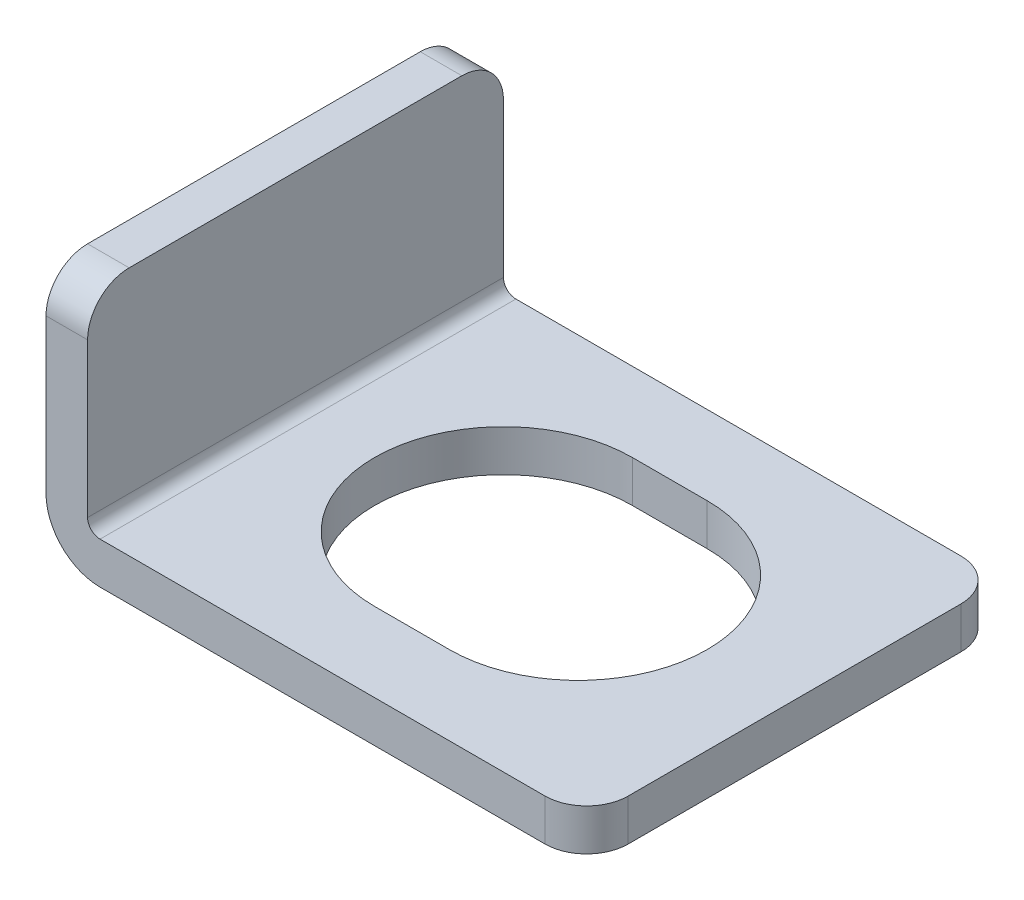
ISO-10303-21;
HEADER;
FILE_DESCRIPTION(('STEP AP214'),'2;1');
FILE_NAME('part.step','',(''),(''),'','','');
FILE_SCHEMA(('AUTOMOTIVE_DESIGN { 1 0 10303 214 1 1 1 1 }'));
ENDSEC;
DATA;
#1=APPLICATION_CONTEXT('core data for automotive mechanical design processes');
#2=APPLICATION_PROTOCOL_DEFINITION('international standard','automotive_design',2000,#1);
#3=PRODUCT_CONTEXT('',#1,'mechanical');
#4=PRODUCT('Part','Part','',(#3));
#5=PRODUCT_RELATED_PRODUCT_CATEGORY('part','',(#4));
#6=PRODUCT_DEFINITION_FORMATION('','',#4);
#7=PRODUCT_DEFINITION_CONTEXT('part definition',#1,'design');
#8=PRODUCT_DEFINITION('design','',#6,#7);
#9=PRODUCT_DEFINITION_SHAPE('','',#8);
#10=(LENGTH_UNIT() NAMED_UNIT(*) SI_UNIT(.MILLI.,.METRE.));
#11=(NAMED_UNIT(*) PLANE_ANGLE_UNIT() SI_UNIT($,.RADIAN.));
#12=(NAMED_UNIT(*) SI_UNIT($,.STERADIAN.) SOLID_ANGLE_UNIT());
#13=UNCERTAINTY_MEASURE_WITH_UNIT(LENGTH_MEASURE(1.E-05),#10,'distance_accuracy_value','');
#14=(GEOMETRIC_REPRESENTATION_CONTEXT(3) GLOBAL_UNCERTAINTY_ASSIGNED_CONTEXT((#13)) GLOBAL_UNIT_ASSIGNED_CONTEXT((#10,
#11,#12)) REPRESENTATION_CONTEXT('',''));
#15=CARTESIAN_POINT('',(0.,0.,0.));
#16=DIRECTION('',(0.,0.,1.));
#17=DIRECTION('',(1.,0.,0.));
#18=AXIS2_PLACEMENT_3D('',#15,#16,#17);
#19=CARTESIAN_POINT('',(-5.,0.3,5.));
#20=DIRECTION('',(-1.,0.,0.));
#21=DIRECTION('',(0.,-1.,0.));
#22=AXIS2_PLACEMENT_3D('',#19,#20,#21);
#23=PLANE('',#22);
#24=DIRECTION('',(0.,1.,0.));
#25=VECTOR('',#24,1.);
#26=CARTESIAN_POINT('',(-5.,0.3,-5.));
#27=LINE('',#26,#25);
#28=CARTESIAN_POINT('',(-5.,0.3,-5.));
#29=VERTEX_POINT('',#28);
#30=CARTESIAN_POINT('',(-5.,4.,-5.));
#31=VERTEX_POINT('',#30);
#32=EDGE_CURVE('E167',#29,#31,#27,.T.);
#33=ORIENTED_EDGE('',*,*,#32,.T.);
#34=CARTESIAN_POINT('',(-5.,4.,-4.));
#35=DIRECTION('',(-1.,0.,0.));
#36=DIRECTION('',(0.,-1.,0.));
#37=AXIS2_PLACEMENT_3D('',#34,#35,#36);
#38=CIRCLE('',#37,1.);
#39=CARTESIAN_POINT('',(-5.,5.,-4.));
#40=VERTEX_POINT('',#39);
#41=EDGE_CURVE('E245',#31,#40,#38,.F.);
#42=ORIENTED_EDGE('',*,*,#41,.T.);
#43=DIRECTION('',(0.,0.,-1.));
#44=VECTOR('',#43,1.);
#45=CARTESIAN_POINT('',(-5.,5.,5.));
#46=LINE('',#45,#44);
#47=CARTESIAN_POINT('',(-5.,5.,4.));
#48=VERTEX_POINT('',#47);
#49=EDGE_CURVE('E218',#48,#40,#46,.T.);
#50=ORIENTED_EDGE('',*,*,#49,.F.);
#51=CARTESIAN_POINT('',(-5.,4.,4.));
#52=DIRECTION('',(-1.,0.,0.));
#53=DIRECTION('',(0.,-1.,0.));
#54=AXIS2_PLACEMENT_3D('',#51,#52,#53);
#55=CIRCLE('',#54,1.);
#56=CARTESIAN_POINT('',(-5.,4.,5.));
#57=VERTEX_POINT('',#56);
#58=EDGE_CURVE('E243',#48,#57,#55,.F.);
#59=ORIENTED_EDGE('',*,*,#58,.T.);
#60=DIRECTION('',(0.,1.,0.));
#61=VECTOR('',#60,1.);
#62=CARTESIAN_POINT('',(-5.,0.3,5.));
#63=LINE('',#62,#61);
#64=CARTESIAN_POINT('',(-5.,0.3,5.));
#65=VERTEX_POINT('',#64);
#66=EDGE_CURVE('E171',#65,#57,#63,.T.);
#67=ORIENTED_EDGE('',*,*,#66,.F.);
#68=DIRECTION('',(0.,0.,-1.));
#69=VECTOR('',#68,1.);
#70=CARTESIAN_POINT('',(-5.,0.3,5.));
#71=LINE('',#70,#69);
#72=EDGE_CURVE('E186',#65,#29,#71,.T.);
#73=ORIENTED_EDGE('',*,*,#72,.T.);
#74=EDGE_LOOP('',(#33,#42,#50,#59,#67,#73));
#75=FACE_BOUND('',#74,.T.);
#76=ADVANCED_FACE('F14',(#75),#23,.F.);
#77=CARTESIAN_POINT('',(-6.,5.,5.));
#78=DIRECTION('',(0.,1.,0.));
#79=DIRECTION('',(0.,0.,1.));
#80=AXIS2_PLACEMENT_3D('',#77,#78,#79);
#81=PLANE('',#80);
#82=ORIENTED_EDGE('',*,*,#49,.T.);
#83=DIRECTION('',(1.,0.,0.));
#84=VECTOR('',#83,1.);
#85=CARTESIAN_POINT('',(-6.,5.,-4.));
#86=LINE('',#85,#84);
#87=CARTESIAN_POINT('',(-6.,5.,-4.));
#88=VERTEX_POINT('',#87);
#89=EDGE_CURVE('E29',#40,#88,#86,.F.);
#90=ORIENTED_EDGE('',*,*,#89,.T.);
#91=DIRECTION('',(0.,0.,-1.));
#92=VECTOR('',#91,1.);
#93=CARTESIAN_POINT('',(-6.,5.,5.));
#94=LINE('',#93,#92);
#95=CARTESIAN_POINT('',(-6.,5.,4.));
#96=VERTEX_POINT('',#95);
#97=EDGE_CURVE('E216',#96,#88,#94,.T.);
#98=ORIENTED_EDGE('',*,*,#97,.F.);
#99=DIRECTION('',(1.,0.,0.));
#100=VECTOR('',#99,1.);
#101=CARTESIAN_POINT('',(-6.,5.,4.));
#102=LINE('',#101,#100);
#103=EDGE_CURVE('E247',#96,#48,#102,.T.);
#104=ORIENTED_EDGE('',*,*,#103,.T.);
#105=EDGE_LOOP('',(#82,#90,#98,#104));
#106=FACE_BOUND('',#105,.T.);
#107=ADVANCED_FACE('F252',(#106),#81,.T.);
#108=CARTESIAN_POINT('',(-6.,0.3,5.));
#109=DIRECTION('',(-1.,0.,0.));
#110=DIRECTION('',(0.,-1.,0.));
#111=AXIS2_PLACEMENT_3D('',#108,#109,#110);
#112=PLANE('',#111);
#113=ORIENTED_EDGE('',*,*,#97,.T.);
#114=CARTESIAN_POINT('',(-6.,4.,-4.));
#115=DIRECTION('',(-1.,0.,0.));
#116=DIRECTION('',(0.,-1.,0.));
#117=AXIS2_PLACEMENT_3D('',#114,#115,#116);
#118=CIRCLE('',#117,1.);
#119=CARTESIAN_POINT('',(-6.,4.,-5.));
#120=VERTEX_POINT('',#119);
#121=EDGE_CURVE('E9',#88,#120,#118,.T.);
#122=ORIENTED_EDGE('',*,*,#121,.T.);
#123=DIRECTION('',(0.,1.,0.));
#124=VECTOR('',#123,1.);
#125=CARTESIAN_POINT('',(-6.,0.3,-5.));
#126=LINE('',#125,#124);
#127=CARTESIAN_POINT('',(-6.,0.3,-5.));
#128=VERTEX_POINT('',#127);
#129=EDGE_CURVE('E189',#128,#120,#126,.T.);
#130=ORIENTED_EDGE('',*,*,#129,.F.);
#131=DIRECTION('',(0.,0.,-1.));
#132=VECTOR('',#131,1.);
#133=CARTESIAN_POINT('',(-6.,0.3,5.));
#134=LINE('',#133,#132);
#135=CARTESIAN_POINT('',(-6.,0.3,5.));
#136=VERTEX_POINT('',#135);
#137=EDGE_CURVE('E214',#136,#128,#134,.T.);
#138=ORIENTED_EDGE('',*,*,#137,.F.);
#139=DIRECTION('',(0.,1.,0.));
#140=VECTOR('',#139,1.);
#141=CARTESIAN_POINT('',(-6.,0.3,5.));
#142=LINE('',#141,#140);
#143=CARTESIAN_POINT('',(-6.,4.,5.));
#144=VERTEX_POINT('',#143);
#145=EDGE_CURVE('E174',#136,#144,#142,.T.);
#146=ORIENTED_EDGE('',*,*,#145,.T.);
#147=CARTESIAN_POINT('',(-6.,4.,4.));
#148=DIRECTION('',(-1.,0.,0.));
#149=DIRECTION('',(0.,-1.,0.));
#150=AXIS2_PLACEMENT_3D('',#147,#148,#149);
#151=CIRCLE('',#150,1.);
#152=EDGE_CURVE('E22',#144,#96,#151,.T.);
#153=ORIENTED_EDGE('',*,*,#152,.T.);
#154=EDGE_LOOP('',(#113,#122,#130,#138,#146,#153));
#155=FACE_BOUND('',#154,.T.);
#156=ADVANCED_FACE('F267',(#155),#112,.T.);
#157=CARTESIAN_POINT('',(-4.7,0.3,5.));
#158=DIRECTION('',(0.,0.,-1.));
#159=DIRECTION('',(-1.,0.,0.));
#160=AXIS2_PLACEMENT_3D('',#157,#158,#159);
#161=CYLINDRICAL_SURFACE('',#160,1.3);
#162=CARTESIAN_POINT('',(-4.7,0.3,-5.));
#163=DIRECTION('',(0.,0.,1.));
#164=DIRECTION('',(1.,0.,0.));
#165=AXIS2_PLACEMENT_3D('',#162,#163,#164);
#166=CIRCLE('',#165,1.3);
#167=CARTESIAN_POINT('',(-4.7,-1.,-5.));
#168=VERTEX_POINT('',#167);
#169=EDGE_CURVE('E192',#168,#128,#166,.F.);
#170=ORIENTED_EDGE('',*,*,#169,.F.);
#171=DIRECTION('',(0.,0.,-1.));
#172=VECTOR('',#171,1.);
#173=CARTESIAN_POINT('',(-4.7,-1.,5.));
#174=LINE('',#173,#172);
#175=CARTESIAN_POINT('',(-4.7,-1.,5.));
#176=VERTEX_POINT('',#175);
#177=EDGE_CURVE('E211',#176,#168,#174,.T.);
#178=ORIENTED_EDGE('',*,*,#177,.F.);
#179=CARTESIAN_POINT('',(-4.7,0.3,5.));
#180=DIRECTION('',(0.,0.,1.));
#181=DIRECTION('',(1.,0.,0.));
#182=AXIS2_PLACEMENT_3D('',#179,#180,#181);
#183=CIRCLE('',#182,1.3);
#184=EDGE_CURVE('E177',#176,#136,#183,.F.);
#185=ORIENTED_EDGE('',*,*,#184,.T.);
#186=ORIENTED_EDGE('',*,*,#137,.T.);
#187=EDGE_LOOP('',(#170,#178,#185,#186));
#188=FACE_BOUND('',#187,.T.);
#189=ADVANCED_FACE('F276',(#188),#161,.T.);
#190=CARTESIAN_POINT('',(0.,-1.,5.));
#191=DIRECTION('',(0.,-1.,0.));
#192=DIRECTION('',(0.,0.,-1.));
#193=AXIS2_PLACEMENT_3D('',#190,#191,#192);
#194=PLANE('',#193);
#195=CARTESIAN_POINT('',(0.,-1.,0.));
#196=DIRECTION('',(0.,1.,0.));
#197=DIRECTION('',(-1.,0.,0.));
#198=AXIS2_PLACEMENT_3D('',#195,#196,#197);
#199=CIRCLE('',#198,3.1);
#200=CARTESIAN_POINT('',(0.,-1.,-3.1));
#201=VERTEX_POINT('',#200);
#202=CARTESIAN_POINT('',(0.,-1.,3.1));
#203=VERTEX_POINT('',#202);
#204=EDGE_CURVE('E131',#201,#203,#199,.T.);
#205=ORIENTED_EDGE('',*,*,#204,.T.);
#206=DIRECTION('',(1.,0.,0.));
#207=VECTOR('',#206,1.);
#208=CARTESIAN_POINT('',(0.,-1.,3.1));
#209=LINE('',#208,#207);
#210=CARTESIAN_POINT('',(1.8,-1.,3.1));
#211=VERTEX_POINT('',#210);
#212=EDGE_CURVE('E143',#203,#211,#209,.T.);
#213=ORIENTED_EDGE('',*,*,#212,.T.);
#214=CARTESIAN_POINT('',(1.8,-1.,0.));
#215=DIRECTION('',(0.,1.,0.));
#216=DIRECTION('',(1.,0.,0.));
#217=AXIS2_PLACEMENT_3D('',#214,#215,#216);
#218=CIRCLE('',#217,3.1);
#219=CARTESIAN_POINT('',(1.8,-1.,-3.1));
#220=VERTEX_POINT('',#219);
#221=EDGE_CURVE('E147',#211,#220,#218,.T.);
#222=ORIENTED_EDGE('',*,*,#221,.T.);
#223=DIRECTION('',(-1.,0.,0.));
#224=VECTOR('',#223,1.);
#225=CARTESIAN_POINT('',(0.,-1.,-3.1));
#226=LINE('',#225,#224);
#227=EDGE_CURVE('E139',#220,#201,#226,.T.);
#228=ORIENTED_EDGE('',*,*,#227,.T.);
#229=EDGE_LOOP('',(#205,#213,#222,#228));
#230=FACE_BOUND('',#229,.T.);
#231=DIRECTION('',(1.,0.,0.));
#232=VECTOR('',#231,1.);
#233=CARTESIAN_POINT('',(0.,-1.,-5.));
#234=LINE('',#233,#232);
#235=CARTESIAN_POINT('',(6.,-1.,-5.));
#236=VERTEX_POINT('',#235);
#237=EDGE_CURVE('E195',#236,#168,#234,.F.);
#238=ORIENTED_EDGE('',*,*,#237,.F.);
#239=CARTESIAN_POINT('',(6.,-1.,-4.));
#240=DIRECTION('',(0.,-1.,0.));
#241=DIRECTION('',(0.,0.,-1.));
#242=AXIS2_PLACEMENT_3D('',#239,#240,#241);
#243=CIRCLE('',#242,1.);
#244=CARTESIAN_POINT('',(7.,-1.,-4.));
#245=VERTEX_POINT('',#244);
#246=EDGE_CURVE('E228',#236,#245,#243,.T.);
#247=ORIENTED_EDGE('',*,*,#246,.T.);
#248=DIRECTION('',(0.,0.,-1.));
#249=VECTOR('',#248,1.);
#250=CARTESIAN_POINT('',(7.,-1.,5.));
#251=LINE('',#250,#249);
#252=CARTESIAN_POINT('',(7.,-1.,4.));
#253=VERTEX_POINT('',#252);
#254=EDGE_CURVE('E208',#253,#245,#251,.T.);
#255=ORIENTED_EDGE('',*,*,#254,.F.);
#256=CARTESIAN_POINT('',(6.,-1.,4.));
#257=DIRECTION('',(0.,-1.,0.));
#258=DIRECTION('',(0.,0.,-1.));
#259=AXIS2_PLACEMENT_3D('',#256,#257,#258);
#260=CIRCLE('',#259,1.);
#261=CARTESIAN_POINT('',(6.,-1.,5.));
#262=VERTEX_POINT('',#261);
#263=EDGE_CURVE('E226',#253,#262,#260,.T.);
#264=ORIENTED_EDGE('',*,*,#263,.T.);
#265=DIRECTION('',(-1.,0.,0.));
#266=VECTOR('',#265,1.);
#267=CARTESIAN_POINT('',(0.,-1.,5.));
#268=LINE('',#267,#266);
#269=EDGE_CURVE('E180',#262,#176,#268,.T.);
#270=ORIENTED_EDGE('',*,*,#269,.T.);
#271=ORIENTED_EDGE('',*,*,#177,.T.);
#272=EDGE_LOOP('',(#238,#247,#255,#264,#270,#271));
#273=FACE_BOUND('',#272,.T.);
#274=ADVANCED_FACE('F149',(#230,#273),#194,.T.);
#275=CARTESIAN_POINT('',(7.,0.,5.));
#276=DIRECTION('',(1.,0.,0.));
#277=DIRECTION('',(0.,0.,-1.));
#278=AXIS2_PLACEMENT_3D('',#275,#276,#277);
#279=PLANE('',#278);
#280=ORIENTED_EDGE('',*,*,#254,.T.);
#281=DIRECTION('',(0.,-1.,0.));
#282=VECTOR('',#281,1.);
#283=CARTESIAN_POINT('',(7.,0.,-4.));
#284=LINE('',#283,#282);
#285=CARTESIAN_POINT('',(7.,0.,-4.));
#286=VERTEX_POINT('',#285);
#287=EDGE_CURVE('E233',#245,#286,#284,.F.);
#288=ORIENTED_EDGE('',*,*,#287,.T.);
#289=DIRECTION('',(0.,0.,-1.));
#290=VECTOR('',#289,1.);
#291=CARTESIAN_POINT('',(7.,0.,5.));
#292=LINE('',#291,#290);
#293=CARTESIAN_POINT('',(7.,0.,4.));
#294=VERTEX_POINT('',#293);
#295=EDGE_CURVE('E205',#294,#286,#292,.T.);
#296=ORIENTED_EDGE('',*,*,#295,.F.);
#297=DIRECTION('',(0.,-1.,0.));
#298=VECTOR('',#297,1.);
#299=CARTESIAN_POINT('',(7.,0.,4.));
#300=LINE('',#299,#298);
#301=EDGE_CURVE('E230',#294,#253,#300,.T.);
#302=ORIENTED_EDGE('',*,*,#301,.T.);
#303=EDGE_LOOP('',(#280,#288,#296,#302));
#304=FACE_BOUND('',#303,.T.);
#305=ADVANCED_FACE('F291',(#304),#279,.T.);
#306=CARTESIAN_POINT('',(0.,0.,5.));
#307=DIRECTION('',(0.,-1.,0.));
#308=DIRECTION('',(1.,0.,0.));
#309=AXIS2_PLACEMENT_3D('',#306,#307,#308);
#310=PLANE('',#309);
#311=DIRECTION('',(1.,0.,0.));
#312=VECTOR('',#311,1.);
#313=CARTESIAN_POINT('',(0.,0.,3.1));
#314=LINE('',#313,#312);
#315=CARTESIAN_POINT('',(0.,0.,3.1));
#316=VERTEX_POINT('',#315);
#317=CARTESIAN_POINT('',(1.8,0.,3.1));
#318=VERTEX_POINT('',#317);
#319=EDGE_CURVE('E161',#316,#318,#314,.T.);
#320=ORIENTED_EDGE('',*,*,#319,.F.);
#321=CARTESIAN_POINT('',(0.,0.,0.));
#322=DIRECTION('',(0.,1.,0.));
#323=DIRECTION('',(-1.,0.,0.));
#324=AXIS2_PLACEMENT_3D('',#321,#322,#323);
#325=CIRCLE('',#324,3.1);
#326=CARTESIAN_POINT('',(0.,0.,-3.1));
#327=VERTEX_POINT('',#326);
#328=EDGE_CURVE('E134',#327,#316,#325,.T.);
#329=ORIENTED_EDGE('',*,*,#328,.F.);
#330=DIRECTION('',(-1.,0.,0.));
#331=VECTOR('',#330,1.);
#332=CARTESIAN_POINT('',(0.,0.,-3.1));
#333=LINE('',#332,#331);
#334=CARTESIAN_POINT('',(1.8,0.,-3.1));
#335=VERTEX_POINT('',#334);
#336=EDGE_CURVE('E152',#335,#327,#333,.T.);
#337=ORIENTED_EDGE('',*,*,#336,.F.);
#338=CARTESIAN_POINT('',(1.8,0.,0.));
#339=DIRECTION('',(0.,1.,0.));
#340=DIRECTION('',(1.,0.,0.));
#341=AXIS2_PLACEMENT_3D('',#338,#339,#340);
#342=CIRCLE('',#341,3.1);
#343=EDGE_CURVE('E155',#318,#335,#342,.T.);
#344=ORIENTED_EDGE('',*,*,#343,.F.);
#345=EDGE_LOOP('',(#320,#329,#337,#344));
#346=FACE_BOUND('',#345,.T.);
#347=ORIENTED_EDGE('',*,*,#295,.T.);
#348=CARTESIAN_POINT('',(6.,0.,-4.));
#349=DIRECTION('',(0.,-1.,0.));
#350=DIRECTION('',(1.,0.,0.));
#351=AXIS2_PLACEMENT_3D('',#348,#349,#350);
#352=CIRCLE('',#351,1.);
#353=CARTESIAN_POINT('',(6.,0.,-5.));
#354=VERTEX_POINT('',#353);
#355=EDGE_CURVE('E237',#286,#354,#352,.F.);
#356=ORIENTED_EDGE('',*,*,#355,.T.);
#357=DIRECTION('',(-1.,0.,0.));
#358=VECTOR('',#357,1.);
#359=CARTESIAN_POINT('',(0.,0.,-5.));
#360=LINE('',#359,#358);
#361=CARTESIAN_POINT('',(-4.7,0.,-5.));
#362=VERTEX_POINT('',#361);
#363=EDGE_CURVE('E197',#354,#362,#360,.T.);
#364=ORIENTED_EDGE('',*,*,#363,.T.);
#365=DIRECTION('',(0.,0.,-1.));
#366=VECTOR('',#365,1.);
#367=CARTESIAN_POINT('',(-4.7,0.,5.));
#368=LINE('',#367,#366);
#369=CARTESIAN_POINT('',(-4.7,0.,5.));
#370=VERTEX_POINT('',#369);
#371=EDGE_CURVE('E202',#370,#362,#368,.T.);
#372=ORIENTED_EDGE('',*,*,#371,.F.);
#373=DIRECTION('',(-1.,0.,0.));
#374=VECTOR('',#373,1.);
#375=CARTESIAN_POINT('',(0.,0.,5.));
#376=LINE('',#375,#374);
#377=CARTESIAN_POINT('',(6.,0.,5.));
#378=VERTEX_POINT('',#377);
#379=EDGE_CURVE('E182',#378,#370,#376,.T.);
#380=ORIENTED_EDGE('',*,*,#379,.F.);
#381=CARTESIAN_POINT('',(6.,0.,4.));
#382=DIRECTION('',(0.,-1.,0.));
#383=DIRECTION('',(1.,0.,0.));
#384=AXIS2_PLACEMENT_3D('',#381,#382,#383);
#385=CIRCLE('',#384,1.);
#386=EDGE_CURVE('E235',#378,#294,#385,.F.);
#387=ORIENTED_EDGE('',*,*,#386,.T.);
#388=EDGE_LOOP('',(#347,#356,#364,#372,#380,#387));
#389=FACE_BOUND('',#388,.T.);
#390=ADVANCED_FACE('F287',(#346,#389),#310,.F.);
#391=CARTESIAN_POINT('',(-4.7,0.3,5.));
#392=DIRECTION('',(0.,0.,-1.));
#393=DIRECTION('',(-1.,0.,0.));
#394=AXIS2_PLACEMENT_3D('',#391,#392,#393);
#395=CYLINDRICAL_SURFACE('',#394,0.3);
#396=CARTESIAN_POINT('',(-4.7,0.3,-5.));
#397=DIRECTION('',(0.,0.,-1.));
#398=DIRECTION('',(-1.,0.,0.));
#399=AXIS2_PLACEMENT_3D('',#396,#397,#398);
#400=CIRCLE('',#399,0.3);
#401=EDGE_CURVE('E175',#362,#29,#400,.T.);
#402=ORIENTED_EDGE('',*,*,#401,.T.);
#403=ORIENTED_EDGE('',*,*,#72,.F.);
#404=CARTESIAN_POINT('',(-4.7,0.3,5.));
#405=DIRECTION('',(0.,0.,-1.));
#406=DIRECTION('',(-1.,0.,0.));
#407=AXIS2_PLACEMENT_3D('',#404,#405,#406);
#408=CIRCLE('',#407,0.3);
#409=EDGE_CURVE('E184',#370,#65,#408,.T.);
#410=ORIENTED_EDGE('',*,*,#409,.F.);
#411=ORIENTED_EDGE('',*,*,#371,.T.);
#412=EDGE_LOOP('',(#402,#403,#410,#411));
#413=FACE_BOUND('',#412,.T.);
#414=ADVANCED_FACE('F298',(#413),#395,.F.);
#415=CARTESIAN_POINT('',(-4.7,0.3,5.));
#416=DIRECTION('',(0.,0.,1.));
#417=DIRECTION('',(1.,0.,0.));
#418=AXIS2_PLACEMENT_3D('',#415,#416,#417);
#419=PLANE('',#418);
#420=ORIENTED_EDGE('',*,*,#269,.F.);
#421=DIRECTION('',(0.,-1.,0.));
#422=VECTOR('',#421,1.);
#423=CARTESIAN_POINT('',(6.,0.3,5.));
#424=LINE('',#423,#422);
#425=EDGE_CURVE('E241',#262,#378,#424,.F.);
#426=ORIENTED_EDGE('',*,*,#425,.T.);
#427=ORIENTED_EDGE('',*,*,#379,.T.);
#428=ORIENTED_EDGE('',*,*,#409,.T.);
#429=ORIENTED_EDGE('',*,*,#66,.T.);
#430=DIRECTION('',(1.,0.,0.));
#431=VECTOR('',#430,1.);
#432=CARTESIAN_POINT('',(-4.7,4.,5.));
#433=LINE('',#432,#431);
#434=EDGE_CURVE('E239',#57,#144,#433,.F.);
#435=ORIENTED_EDGE('',*,*,#434,.T.);
#436=ORIENTED_EDGE('',*,*,#145,.F.);
#437=ORIENTED_EDGE('',*,*,#184,.F.);
#438=EDGE_LOOP('',(#420,#426,#427,#428,#429,#435,#436,#437));
#439=FACE_BOUND('',#438,.T.);
#440=ADVANCED_FACE('F273',(#439),#419,.T.);
#441=CARTESIAN_POINT('',(-4.7,0.3,-5.));
#442=DIRECTION('',(0.,0.,1.));
#443=DIRECTION('',(1.,0.,0.));
#444=AXIS2_PLACEMENT_3D('',#441,#442,#443);
#445=PLANE('',#444);
#446=ORIENTED_EDGE('',*,*,#363,.F.);
#447=DIRECTION('',(0.,-1.,0.));
#448=VECTOR('',#447,1.);
#449=CARTESIAN_POINT('',(6.,-1.,-5.));
#450=LINE('',#449,#448);
#451=EDGE_CURVE('E223',#354,#236,#450,.T.);
#452=ORIENTED_EDGE('',*,*,#451,.T.);
#453=ORIENTED_EDGE('',*,*,#237,.T.);
#454=ORIENTED_EDGE('',*,*,#169,.T.);
#455=ORIENTED_EDGE('',*,*,#129,.T.);
#456=DIRECTION('',(1.,0.,0.));
#457=VECTOR('',#456,1.);
#458=CARTESIAN_POINT('',(-5.,4.,-5.));
#459=LINE('',#458,#457);
#460=EDGE_CURVE('E220',#120,#31,#459,.T.);
#461=ORIENTED_EDGE('',*,*,#460,.T.);
#462=ORIENTED_EDGE('',*,*,#32,.F.);
#463=ORIENTED_EDGE('',*,*,#401,.F.);
#464=EDGE_LOOP('',(#446,#452,#453,#454,#455,#461,#462,#463));
#465=FACE_BOUND('',#464,.T.);
#466=ADVANCED_FACE('F263',(#465),#445,.F.);
#467=CARTESIAN_POINT('',(0.,-1.,0.));
#468=DIRECTION('',(0.,1.,0.));
#469=DIRECTION('',(-1.,0.,0.));
#470=AXIS2_PLACEMENT_3D('',#467,#468,#469);
#471=CYLINDRICAL_SURFACE('',#470,3.1);
#472=ORIENTED_EDGE('',*,*,#328,.T.);
#473=DIRECTION('',(0.,1.,0.));
#474=VECTOR('',#473,1.);
#475=CARTESIAN_POINT('',(0.,-1.,3.1));
#476=LINE('',#475,#474);
#477=EDGE_CURVE('E127',#203,#316,#476,.T.);
#478=ORIENTED_EDGE('',*,*,#477,.F.);
#479=ORIENTED_EDGE('',*,*,#204,.F.);
#480=DIRECTION('',(0.,1.,0.));
#481=VECTOR('',#480,1.);
#482=CARTESIAN_POINT('',(0.,-1.,-3.1));
#483=LINE('',#482,#481);
#484=EDGE_CURVE('E165',#201,#327,#483,.T.);
#485=ORIENTED_EDGE('',*,*,#484,.T.);
#486=EDGE_LOOP('',(#472,#478,#479,#485));
#487=FACE_BOUND('',#486,.T.);
#488=ADVANCED_FACE('F129',(#487),#471,.F.);
#489=CARTESIAN_POINT('',(0.,-1.,-3.1));
#490=DIRECTION('',(0.,0.,-1.));
#491=DIRECTION('',(-1.,0.,0.));
#492=AXIS2_PLACEMENT_3D('',#489,#490,#491);
#493=PLANE('',#492);
#494=ORIENTED_EDGE('',*,*,#336,.T.);
#495=ORIENTED_EDGE('',*,*,#484,.F.);
#496=ORIENTED_EDGE('',*,*,#227,.F.);
#497=DIRECTION('',(0.,1.,0.));
#498=VECTOR('',#497,1.);
#499=CARTESIAN_POINT('',(1.8,-1.,-3.1));
#500=LINE('',#499,#498);
#501=EDGE_CURVE('E168',#220,#335,#500,.T.);
#502=ORIENTED_EDGE('',*,*,#501,.T.);
#503=EDGE_LOOP('',(#494,#495,#496,#502));
#504=FACE_BOUND('',#503,.T.);
#505=ADVANCED_FACE('F368',(#504),#493,.F.);
#506=CARTESIAN_POINT('',(1.8,-1.,0.));
#507=DIRECTION('',(0.,1.,0.));
#508=DIRECTION('',(-1.,0.,0.));
#509=AXIS2_PLACEMENT_3D('',#506,#507,#508);
#510=CYLINDRICAL_SURFACE('',#509,3.1);
#511=ORIENTED_EDGE('',*,*,#343,.T.);
#512=ORIENTED_EDGE('',*,*,#501,.F.);
#513=ORIENTED_EDGE('',*,*,#221,.F.);
#514=DIRECTION('',(0.,1.,0.));
#515=VECTOR('',#514,1.);
#516=CARTESIAN_POINT('',(1.8,-1.,3.1));
#517=LINE('',#516,#515);
#518=EDGE_CURVE('E138',#211,#318,#517,.T.);
#519=ORIENTED_EDGE('',*,*,#518,.T.);
#520=EDGE_LOOP('',(#511,#512,#513,#519));
#521=FACE_BOUND('',#520,.T.);
#522=ADVANCED_FACE('F361',(#521),#510,.F.);
#523=CARTESIAN_POINT('',(0.,-1.,3.1));
#524=DIRECTION('',(0.,0.,1.));
#525=DIRECTION('',(1.,0.,0.));
#526=AXIS2_PLACEMENT_3D('',#523,#524,#525);
#527=PLANE('',#526);
#528=ORIENTED_EDGE('',*,*,#319,.T.);
#529=ORIENTED_EDGE('',*,*,#518,.F.);
#530=ORIENTED_EDGE('',*,*,#212,.F.);
#531=ORIENTED_EDGE('',*,*,#477,.T.);
#532=EDGE_LOOP('',(#528,#529,#530,#531));
#533=FACE_BOUND('',#532,.T.);
#534=ADVANCED_FACE('F144',(#533),#527,.F.);
#535=CARTESIAN_POINT('',(6.,0.3,-4.));
#536=DIRECTION('',(0.,1.,0.));
#537=DIRECTION('',(0.,0.,1.));
#538=AXIS2_PLACEMENT_3D('',#535,#536,#537);
#539=CYLINDRICAL_SURFACE('',#538,1.);
#540=ORIENTED_EDGE('',*,*,#355,.F.);
#541=ORIENTED_EDGE('',*,*,#287,.F.);
#542=ORIENTED_EDGE('',*,*,#246,.F.);
#543=ORIENTED_EDGE('',*,*,#451,.F.);
#544=EDGE_LOOP('',(#540,#541,#542,#543));
#545=FACE_BOUND('',#544,.T.);
#546=ADVANCED_FACE('F294',(#545),#539,.T.);
#547=CARTESIAN_POINT('',(6.,0.,4.));
#548=DIRECTION('',(0.,-1.,0.));
#549=DIRECTION('',(0.,0.,-1.));
#550=AXIS2_PLACEMENT_3D('',#547,#548,#549);
#551=CYLINDRICAL_SURFACE('',#550,1.);
#552=ORIENTED_EDGE('',*,*,#386,.F.);
#553=ORIENTED_EDGE('',*,*,#425,.F.);
#554=ORIENTED_EDGE('',*,*,#263,.F.);
#555=ORIENTED_EDGE('',*,*,#301,.F.);
#556=EDGE_LOOP('',(#552,#553,#554,#555));
#557=FACE_BOUND('',#556,.T.);
#558=ADVANCED_FACE('F283',(#557),#551,.T.);
#559=CARTESIAN_POINT('',(-4.7,4.,-4.));
#560=DIRECTION('',(-1.,0.,0.));
#561=DIRECTION('',(0.,0.,1.));
#562=AXIS2_PLACEMENT_3D('',#559,#560,#561);
#563=CYLINDRICAL_SURFACE('',#562,1.);
#564=ORIENTED_EDGE('',*,*,#121,.F.);
#565=ORIENTED_EDGE('',*,*,#89,.F.);
#566=ORIENTED_EDGE('',*,*,#41,.F.);
#567=ORIENTED_EDGE('',*,*,#460,.F.);
#568=EDGE_LOOP('',(#564,#565,#566,#567));
#569=FACE_BOUND('',#568,.T.);
#570=ADVANCED_FACE('F260',(#569),#563,.T.);
#571=CARTESIAN_POINT('',(-6.,4.,4.));
#572=DIRECTION('',(1.,0.,0.));
#573=DIRECTION('',(0.,0.,-1.));
#574=AXIS2_PLACEMENT_3D('',#571,#572,#573);
#575=CYLINDRICAL_SURFACE('',#574,1.);
#576=ORIENTED_EDGE('',*,*,#152,.F.);
#577=ORIENTED_EDGE('',*,*,#434,.F.);
#578=ORIENTED_EDGE('',*,*,#58,.F.);
#579=ORIENTED_EDGE('',*,*,#103,.F.);
#580=EDGE_LOOP('',(#576,#577,#578,#579));
#581=FACE_BOUND('',#580,.T.);
#582=ADVANCED_FACE('F16',(#581),#575,.T.);
#583=CLOSED_SHELL('',(#76,#107,#156,#189,#274,#305,#390,#414,#440,#466,#488,#505,#522,#534,#546,
#558,#570,#582));
#584=MANIFOLD_SOLID_BREP('B1',#583);
#585=ADVANCED_BREP_SHAPE_REPRESENTATION('',(#18,#584),#14);
#586=SHAPE_DEFINITION_REPRESENTATION(#9,#585);
ENDSEC;
END-ISO-10303-21;
